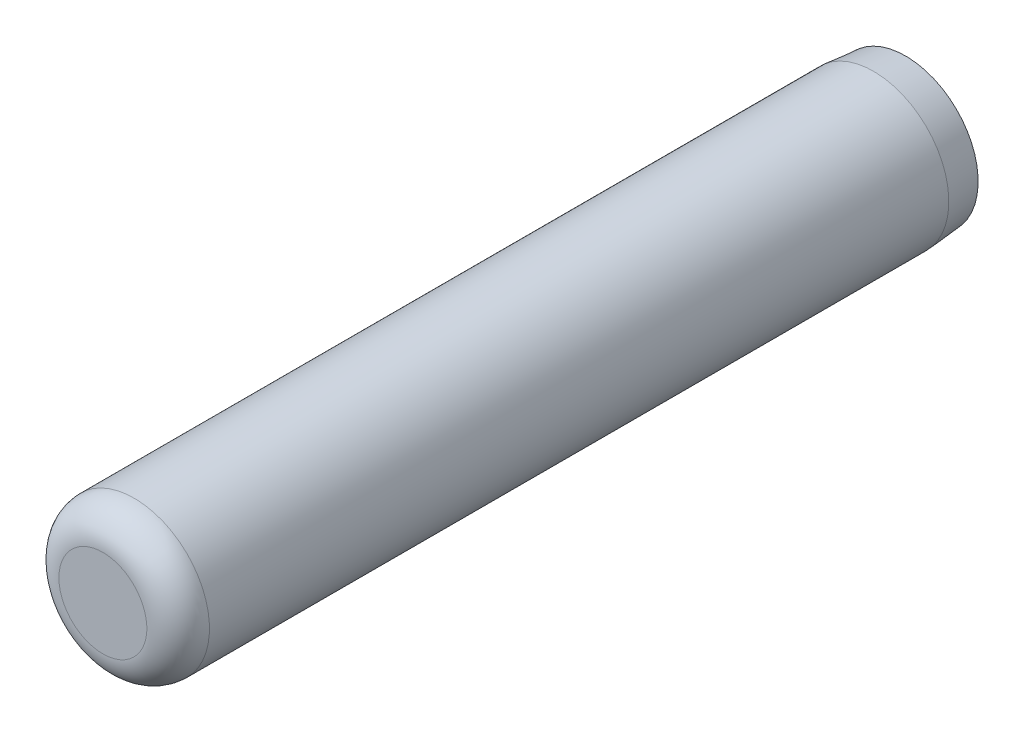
ISO-10303-21;
HEADER;
FILE_DESCRIPTION(('STEP AP214'),'2;1');
FILE_NAME('part.step','',(''),(''),'','','');
FILE_SCHEMA(('AUTOMOTIVE_DESIGN { 1 0 10303 214 1 1 1 1 }'));
ENDSEC;
DATA;
#1=APPLICATION_CONTEXT('core data for automotive mechanical design processes');
#2=APPLICATION_PROTOCOL_DEFINITION('international standard','automotive_design',2000,#1);
#3=PRODUCT_CONTEXT('',#1,'mechanical');
#4=PRODUCT('Part','Part','',(#3));
#5=PRODUCT_RELATED_PRODUCT_CATEGORY('part','',(#4));
#6=PRODUCT_DEFINITION_FORMATION('','',#4);
#7=PRODUCT_DEFINITION_CONTEXT('part definition',#1,'design');
#8=PRODUCT_DEFINITION('design','',#6,#7);
#9=PRODUCT_DEFINITION_SHAPE('','',#8);
#10=(LENGTH_UNIT() NAMED_UNIT(*) SI_UNIT(.MILLI.,.METRE.));
#11=(NAMED_UNIT(*) PLANE_ANGLE_UNIT() SI_UNIT($,.RADIAN.));
#12=(NAMED_UNIT(*) SI_UNIT($,.STERADIAN.) SOLID_ANGLE_UNIT());
#13=UNCERTAINTY_MEASURE_WITH_UNIT(LENGTH_MEASURE(1.E-05),#10,'distance_accuracy_value','');
#14=(GEOMETRIC_REPRESENTATION_CONTEXT(3) GLOBAL_UNCERTAINTY_ASSIGNED_CONTEXT((#13)) GLOBAL_UNIT_ASSIGNED_CONTEXT((#10,
#11,#12)) REPRESENTATION_CONTEXT('',''));
#15=CARTESIAN_POINT('',(0.,0.,0.));
#16=DIRECTION('',(0.,0.,1.));
#17=DIRECTION('',(1.,0.,0.));
#18=AXIS2_PLACEMENT_3D('',#15,#16,#17);
#19=CARTESIAN_POINT('',(0.,0.,29.7688));
#20=DIRECTION('',(0.,0.,-1.));
#21=DIRECTION('',(-1.,0.,0.));
#22=AXIS2_PLACEMENT_3D('',#19,#20,#21);
#23=TOROIDAL_SURFACE('',#22,2.7813,1.9812);
#24=CARTESIAN_POINT('',(0.,0.,29.7688));
#25=DIRECTION('',(0.,0.,-1.));
#26=DIRECTION('',(-1.,0.,0.));
#27=AXIS2_PLACEMENT_3D('',#24,#25,#26);
#28=CIRCLE('',#27,4.7625);
#29=CARTESIAN_POINT('',(-4.76250000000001,0.,29.7688));
#30=VERTEX_POINT('',#29);
#31=EDGE_CURVE('E10',#30,#30,#28,.T.);
#32=ORIENTED_EDGE('',*,*,#31,.F.);
#33=EDGE_LOOP('',(#32));
#34=FACE_BOUND('',#33,.T.);
#35=CARTESIAN_POINT('',(0.,0.,31.75));
#36=DIRECTION('',(0.,0.,-1.));
#37=DIRECTION('',(-1.,0.,0.));
#38=AXIS2_PLACEMENT_3D('',#35,#36,#37);
#39=CIRCLE('',#38,2.7813);
#40=CARTESIAN_POINT('',(-2.78130000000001,0.,31.75));
#41=VERTEX_POINT('',#40);
#42=EDGE_CURVE('E58',#41,#41,#39,.T.);
#43=ORIENTED_EDGE('',*,*,#42,.T.);
#44=EDGE_LOOP('',(#43));
#45=FACE_BOUND('',#44,.T.);
#46=ADVANCED_FACE('F39',(#34,#45),#23,.T.);
#47=CARTESIAN_POINT('',(0.,0.,-47.5372037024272));
#48=DIRECTION('',(0.,0.,-1.));
#49=DIRECTION('',(-1.,0.,0.));
#50=AXIS2_PLACEMENT_3D('',#47,#48,#49);
#51=CYLINDRICAL_SURFACE('',#50,4.7625);
#52=CARTESIAN_POINT('',(0.,0.,-17.018));
#53=DIRECTION('',(0.,0.,-1.));
#54=DIRECTION('',(-1.,0.,0.));
#55=AXIS2_PLACEMENT_3D('',#52,#53,#54);
#56=CIRCLE('',#55,4.7625);
#57=CARTESIAN_POINT('',(-4.7625,0.,-17.018));
#58=VERTEX_POINT('',#57);
#59=EDGE_CURVE('E46',#58,#58,#56,.T.);
#60=ORIENTED_EDGE('',*,*,#59,.F.);
#61=EDGE_LOOP('',(#60));
#62=FACE_BOUND('',#61,.T.);
#63=ORIENTED_EDGE('',*,*,#31,.T.);
#64=EDGE_LOOP('',(#63));
#65=FACE_BOUND('',#64,.T.);
#66=ADVANCED_FACE('F78',(#62,#65),#51,.T.);
#67=CARTESIAN_POINT('',(0.,0.,-17.018));
#68=DIRECTION('',(0.,0.,1.));
#69=DIRECTION('',(1.,0.,0.));
#70=AXIS2_PLACEMENT_3D('',#67,#68,#69);
#71=CONICAL_SURFACE('',#70,4.7625,0.0872664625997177);
#72=CARTESIAN_POINT('',(0.,0.,-19.05));
#73=DIRECTION('',(0.,0.,-1.));
#74=DIRECTION('',(-1.,0.,0.));
#75=AXIS2_PLACEMENT_3D('',#72,#73,#74);
#76=CIRCLE('',#75,4.58472303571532);
#77=CARTESIAN_POINT('',(-4.58472303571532,0.,-19.05));
#78=VERTEX_POINT('',#77);
#79=EDGE_CURVE('E52',#78,#78,#76,.T.);
#80=ORIENTED_EDGE('',*,*,#79,.F.);
#81=EDGE_LOOP('',(#80));
#82=FACE_BOUND('',#81,.T.);
#83=ORIENTED_EDGE('',*,*,#59,.T.);
#84=EDGE_LOOP('',(#83));
#85=FACE_BOUND('',#84,.T.);
#86=ADVANCED_FACE('F74',(#82,#85),#71,.T.);
#87=CARTESIAN_POINT('',(0.,0.,-19.05));
#88=DIRECTION('',(0.,0.,1.));
#89=DIRECTION('',(1.,0.,0.));
#90=AXIS2_PLACEMENT_3D('',#87,#88,#89);
#91=PLANE('',#90);
#92=ORIENTED_EDGE('',*,*,#79,.T.);
#93=EDGE_LOOP('',(#92));
#94=FACE_BOUND('',#93,.T.);
#95=ADVANCED_FACE('F69',(#94),#91,.F.);
#96=CARTESIAN_POINT('',(0.,0.,31.75));
#97=DIRECTION('',(0.,0.,-1.));
#98=DIRECTION('',(-1.,0.,0.));
#99=AXIS2_PLACEMENT_3D('',#96,#97,#98);
#100=PLANE('',#99);
#101=ORIENTED_EDGE('',*,*,#42,.F.);
#102=EDGE_LOOP('',(#101));
#103=FACE_BOUND('',#102,.T.);
#104=ADVANCED_FACE('F67',(#103),#100,.F.);
#105=CLOSED_SHELL('',(#46,#66,#86,#95,#104));
#106=MANIFOLD_SOLID_BREP('B2',#105);
#107=ADVANCED_BREP_SHAPE_REPRESENTATION('',(#18,#106),#14);
#108=SHAPE_DEFINITION_REPRESENTATION(#9,#107);
ENDSEC;
END-ISO-10303-21;
